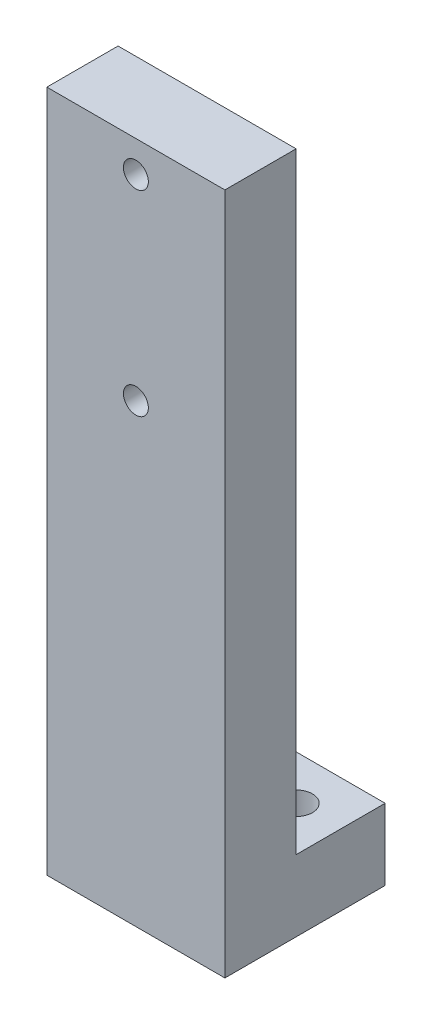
from build123d import *

# Parameters (mm, degrees)
SKETCH_1_W               = 30
SKETCH_1_H               = 115
SKETCH_1_R               = 2.1
EXTRUDE_1_DEPTH          = 27
CUT_EXTRUDE_1_DEPTH      = 122.876987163
CUT_EXTRUDE_1_DEPTH_BACK = 122.876987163
SKETCH_2_W               = 15
SKETCH_2_H               = 103
SKETCH_3_R               = 2.75
CUT_EXTRUDE_2_DEPTH      = 27


with BuildPart() as part:
    # Sketch 1 → Extrude 1 (new body)
    with BuildSketch(Plane.XY):
        with Locations((15, 57.5)):
            Rectangle(SKETCH_1_W, SKETCH_1_H)
        with Locations((15, 109.74)):
            Circle(SKETCH_1_R, mode=Mode.SUBTRACT)
        with Locations((15, 76.74)):
            Circle(SKETCH_1_R, mode=Mode.SUBTRACT)
    extrude(amount=EXTRUDE_1_DEPTH)

    # Sketch 2 → Cut-Extrude 1 (cut, two sides: drawn at the far end of the back side and taken through both)
    with BuildSketch(Plane(origin=(30, 0, 0), x_dir=(0, 0, -1), z_dir=(1, 0, 0)).offset(-CUT_EXTRUDE_1_DEPTH_BACK)):
        with Locations((-7.5, 63.5)):
            Rectangle(SKETCH_2_W, SKETCH_2_H)
    extrude(amount=CUT_EXTRUDE_1_DEPTH + CUT_EXTRUDE_1_DEPTH_BACK, mode=Mode.SUBTRACT)

    # Sketch 3 → Cut-Extrude 2 (cut)
    with BuildSketch(Plane(origin=(0, 12, 0), x_dir=(1, 0, 0), z_dir=(0, 1, 0))):
        with Locations(Location((7.5, -7.5, 0), (0, 0, 270))):
            Circle(SKETCH_3_R)
        with Locations(Location((22.5, -7.5, 0), (0, 0, 270))):
            Circle(SKETCH_3_R)
    extrude(amount=-CUT_EXTRUDE_2_DEPTH, mode=Mode.SUBTRACT)


solid = part.part
